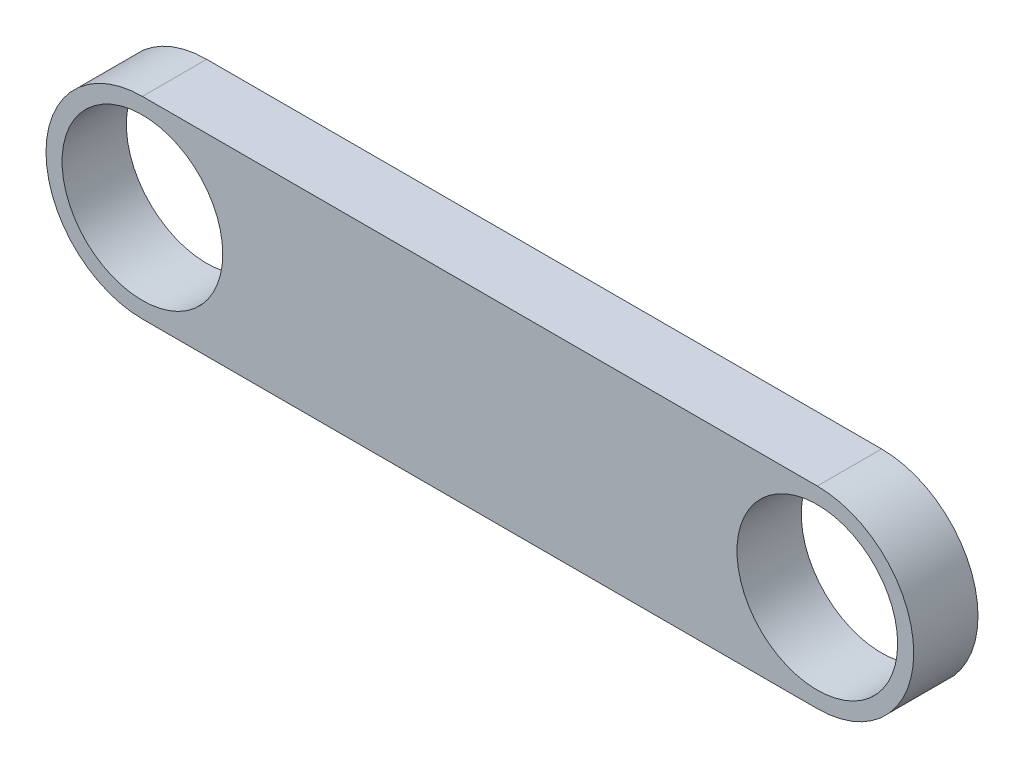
from build123d import *

# Parameters (mm, degrees)
SKETCH1_R           = 12.5
BOSS_EXTRUDE1_DEPTH = 10


with BuildPart() as part:
    # Sketch1 → Boss-Extrude1 (new body)
    with BuildSketch(Plane.XY):
        with BuildLine():
            Line((0, 15), (105, 15))
            ThreePointArc((105, 15), (120, 0), (105, -15))
            Line((105, -15), (0, -15))
            ThreePointArc((0, -15), (-15, 0), (0, 15))
        make_face()
        Circle(SKETCH1_R, mode=Mode.SUBTRACT)
        with Locations((105, 0)):
            Circle(SKETCH1_R, mode=Mode.SUBTRACT)
    extrude(amount=BOSS_EXTRUDE1_DEPTH)


solid = part.part
